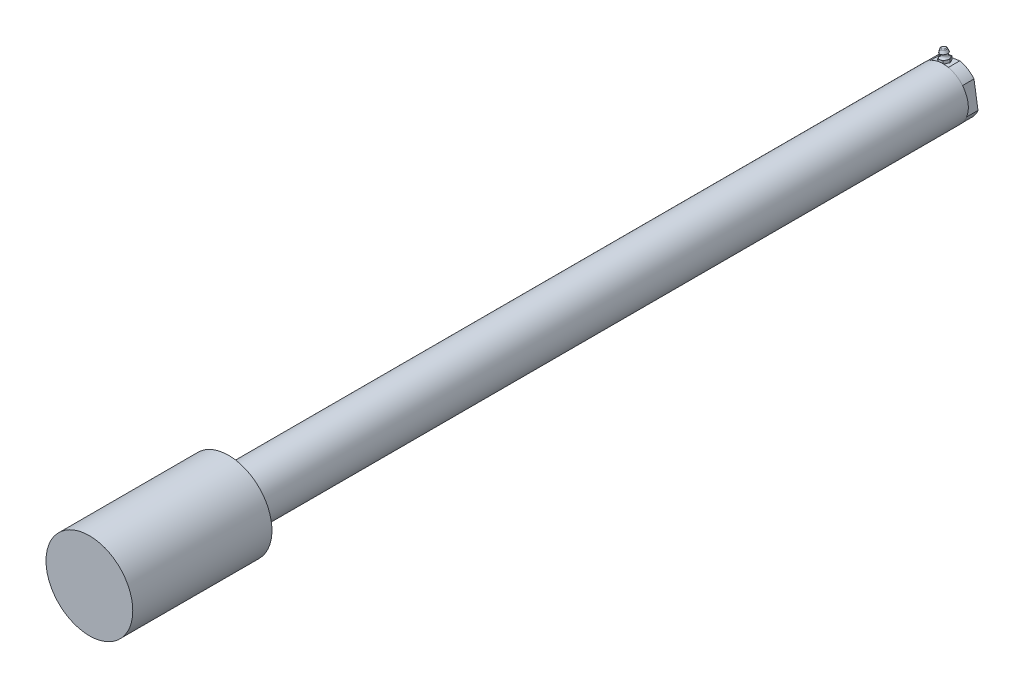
ISO-10303-21;
HEADER;
FILE_DESCRIPTION(('STEP AP214'),'2;1');
FILE_NAME('part.step','',(''),(''),'','','');
FILE_SCHEMA(('AUTOMOTIVE_DESIGN { 1 0 10303 214 1 1 1 1 }'));
ENDSEC;
DATA;
#1=APPLICATION_CONTEXT('core data for automotive mechanical design processes');
#2=APPLICATION_PROTOCOL_DEFINITION('international standard','automotive_design',2000,#1);
#3=PRODUCT_CONTEXT('',#1,'mechanical');
#4=PRODUCT('Part','Part','',(#3));
#5=PRODUCT_RELATED_PRODUCT_CATEGORY('part','',(#4));
#6=PRODUCT_DEFINITION_FORMATION('','',#4);
#7=PRODUCT_DEFINITION_CONTEXT('part definition',#1,'design');
#8=PRODUCT_DEFINITION('design','',#6,#7);
#9=PRODUCT_DEFINITION_SHAPE('','',#8);
#10=(LENGTH_UNIT() NAMED_UNIT(*) SI_UNIT(.MILLI.,.METRE.));
#11=(NAMED_UNIT(*) PLANE_ANGLE_UNIT() SI_UNIT($,.RADIAN.));
#12=(NAMED_UNIT(*) SI_UNIT($,.STERADIAN.) SOLID_ANGLE_UNIT());
#13=UNCERTAINTY_MEASURE_WITH_UNIT(LENGTH_MEASURE(1.E-05),#10,'distance_accuracy_value','');
#14=(GEOMETRIC_REPRESENTATION_CONTEXT(3) GLOBAL_UNCERTAINTY_ASSIGNED_CONTEXT((#13)) GLOBAL_UNIT_ASSIGNED_CONTEXT((#10,
#11,#12)) REPRESENTATION_CONTEXT('',''));
#15=CARTESIAN_POINT('',(0.,0.,0.));
#16=DIRECTION('',(0.,0.,1.));
#17=DIRECTION('',(1.,0.,0.));
#18=AXIS2_PLACEMENT_3D('',#15,#16,#17);
#19=CARTESIAN_POINT('',(0.,0.,-721.7156));
#20=DIRECTION('',(0.,0.,-1.));
#21=DIRECTION('',(-0.156434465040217,0.98768834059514,0.));
#22=AXIS2_PLACEMENT_3D('',#19,#20,#21);
#23=PLANE('',#22);
#24=CARTESIAN_POINT('',(0.,0.,-721.7156));
#25=DIRECTION('',(0.,0.,-1.));
#26=DIRECTION('',(-0.156434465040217,0.98768834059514,0.));
#27=AXIS2_PLACEMENT_3D('',#24,#25,#26);
#28=CIRCLE('',#27,8.73125);
#29=CARTESIAN_POINT('',(-1.3658684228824,8.62375382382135,-721.7156));
#30=VERTEX_POINT('',#29);
#31=EDGE_CURVE('E197',#30,#30,#28,.T.);
#32=ORIENTED_EDGE('',*,*,#31,.T.);
#33=EDGE_LOOP('',(#32));
#34=FACE_BOUND('',#33,.T.);
#35=ADVANCED_FACE('F19',(#34),#23,.T.);
#36=CARTESIAN_POINT('',(0.,0.,-759.8156));
#37=DIRECTION('',(0.,0.,-1.));
#38=DIRECTION('',(-0.156434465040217,0.98768834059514,0.));
#39=AXIS2_PLACEMENT_3D('',#36,#37,#38);
#40=CYLINDRICAL_SURFACE('',#39,8.73125);
#41=ORIENTED_EDGE('',*,*,#31,.F.);
#42=EDGE_LOOP('',(#41));
#43=FACE_BOUND('',#42,.T.);
#44=CARTESIAN_POINT('',(0.,0.,-759.8156));
#45=DIRECTION('',(0.,0.,-1.));
#46=DIRECTION('',(-0.156434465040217,0.98768834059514,0.));
#47=AXIS2_PLACEMENT_3D('',#44,#45,#46);
#48=CIRCLE('',#47,8.73125);
#49=CARTESIAN_POINT('',(-1.3658684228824,8.62375382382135,-759.8156));
#50=VERTEX_POINT('',#49);
#51=EDGE_CURVE('E669',#50,#50,#48,.T.);
#52=ORIENTED_EDGE('',*,*,#51,.T.);
#53=EDGE_LOOP('',(#52));
#54=FACE_BOUND('',#53,.T.);
#55=ADVANCED_FACE('F550',(#43,#54),#40,.F.);
#56=CARTESIAN_POINT('',(0.,0.,-749.6556));
#57=DIRECTION('',(0.,0.,-1.));
#58=DIRECTION('',(-0.156434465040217,0.98768834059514,0.));
#59=AXIS2_PLACEMENT_3D('',#56,#57,#58);
#60=CYLINDRICAL_SURFACE('',#59,22.1107);
#61=DIRECTION('',(0.,0.,-1.));
#62=VECTOR('',#61,1.);
#63=CARTESIAN_POINT('',(-17.0596258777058,-14.0659951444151,-726.999693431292));
#64=LINE('',#63,#62);
#65=CARTESIAN_POINT('',(-17.0596258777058,-14.0659951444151,-749.6556));
#66=VERTEX_POINT('',#65);
#67=CARTESIAN_POINT('',(-17.0596258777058,-14.0659951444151,-759.8156));
#68=VERTEX_POINT('',#67);
#69=EDGE_CURVE('E653',#66,#68,#64,.T.);
#70=ORIENTED_EDGE('',*,*,#69,.T.);
#71=CARTESIAN_POINT('',(0.,0.,-759.8156));
#72=DIRECTION('',(0.,0.,-1.));
#73=DIRECTION('',(-0.156434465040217,0.98768834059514,0.));
#74=AXIS2_PLACEMENT_3D('',#71,#72,#73);
#75=CIRCLE('',#74,22.1107);
#76=CARTESIAN_POINT('',(20.571299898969,-8.10584202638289,-759.8156));
#77=VERTEX_POINT('',#76);
#78=EDGE_CURVE('E676',#77,#68,#75,.T.);
#79=ORIENTED_EDGE('',*,*,#78,.F.);
#80=DIRECTION('',(0.,0.,-1.));
#81=VECTOR('',#80,1.);
#82=CARTESIAN_POINT('',(20.571299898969,-8.10584202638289,-726.999693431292));
#83=LINE('',#82,#81);
#84=CARTESIAN_POINT('',(20.571299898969,-8.10584202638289,-749.6556));
#85=VERTEX_POINT('',#84);
#86=EDGE_CURVE('E662',#85,#77,#83,.T.);
#87=ORIENTED_EDGE('',*,*,#86,.F.);
#88=CARTESIAN_POINT('',(0.,0.,-749.6556));
#89=DIRECTION('',(0.,0.,-1.));
#90=DIRECTION('',(-0.156434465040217,0.98768834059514,0.));
#91=AXIS2_PLACEMENT_3D('',#88,#89,#90);
#92=CIRCLE('',#91,22.1107);
#93=EDGE_CURVE('E673',#85,#66,#92,.T.);
#94=ORIENTED_EDGE('',*,*,#93,.T.);
#95=EDGE_LOOP('',(#70,#79,#87,#94));
#96=FACE_BOUND('',#95,.T.);
#97=ADVANCED_FACE('F522',(#96),#60,.T.);
#98=DIRECTION('',(0.,0.,-1.));
#99=VECTOR('',#98,1.);
#100=CARTESIAN_POINT('',(-11.0680891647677,19.1410672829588,-733.712329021));
#101=LINE('',#100,#99);
#102=CARTESIAN_POINT('',(-11.0680891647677,19.1410672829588,-749.6556));
#103=VERTEX_POINT('',#102);
#104=CARTESIAN_POINT('',(-11.0680891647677,19.1410672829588,-759.8156));
#105=VERTEX_POINT('',#104);
#106=EDGE_CURVE('E645',#103,#105,#101,.T.);
#107=ORIENTED_EDGE('',*,*,#106,.T.);
#108=CARTESIAN_POINT('',(-20.5712998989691,8.10584202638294,-759.8156));
#109=VERTEX_POINT('',#108);
#110=EDGE_CURVE('E678',#109,#105,#75,.T.);
#111=ORIENTED_EDGE('',*,*,#110,.F.);
#112=DIRECTION('',(0.,0.,-1.));
#113=VECTOR('',#112,1.);
#114=CARTESIAN_POINT('',(-20.5712998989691,8.10584202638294,-726.999693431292));
#115=LINE('',#114,#113);
#116=CARTESIAN_POINT('',(-20.5712998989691,8.10584202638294,-749.6556));
#117=VERTEX_POINT('',#116);
#118=EDGE_CURVE('E652',#117,#109,#115,.T.);
#119=ORIENTED_EDGE('',*,*,#118,.F.);
#120=EDGE_CURVE('E674',#117,#103,#92,.T.);
#121=ORIENTED_EDGE('',*,*,#120,.T.);
#122=EDGE_LOOP('',(#107,#111,#119,#121));
#123=FACE_BOUND('',#122,.T.);
#124=ADVANCED_FACE('F521',(#123),#60,.T.);
#125=CARTESIAN_POINT('',(0.,0.,-759.8156));
#126=DIRECTION('',(0.,0.,-1.));
#127=DIRECTION('',(-0.156434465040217,0.98768834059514,0.));
#128=AXIS2_PLACEMENT_3D('',#125,#126,#127);
#129=PLANE('',#128);
#130=DIRECTION('',(-0.98768834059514,-0.156434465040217,0.));
#131=VECTOR('',#130,1.);
#132=CARTESIAN_POINT('',(4.61146324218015,21.6244644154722,-759.8156));
#133=LINE('',#132,#131);
#134=CARTESIAN_POINT('',(4.61146324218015,21.6244644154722,-759.8156));
#135=VERTEX_POINT('',#134);
#136=EDGE_CURVE('E94',#135,#105,#133,.T.);
#137=ORIENTED_EDGE('',*,*,#136,.F.);
#138=CARTESIAN_POINT('',(17.0596258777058,14.0659951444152,-759.8156));
#139=VERTEX_POINT('',#138);
#140=EDGE_CURVE('E672',#135,#139,#75,.T.);
#141=ORIENTED_EDGE('',*,*,#140,.T.);
#142=DIRECTION('',(-0.156434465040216,0.98768834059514,0.));
#143=VECTOR('',#142,1.);
#144=CARTESIAN_POINT('',(20.571299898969,-8.10584202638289,-759.8156));
#145=LINE('',#144,#143);
#146=EDGE_CURVE('E659',#77,#139,#145,.T.);
#147=ORIENTED_EDGE('',*,*,#146,.F.);
#148=ORIENTED_EDGE('',*,*,#78,.T.);
#149=DIRECTION('',(0.156434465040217,-0.98768834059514,0.));
#150=VECTOR('',#149,1.);
#151=CARTESIAN_POINT('',(-17.0596258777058,-14.0659951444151,-759.8156));
#152=LINE('',#151,#150);
#153=EDGE_CURVE('E650',#109,#68,#152,.T.);
#154=ORIENTED_EDGE('',*,*,#153,.F.);
#155=ORIENTED_EDGE('',*,*,#110,.T.);
#156=EDGE_LOOP('',(#137,#141,#147,#148,#154,#155));
#157=FACE_BOUND('',#156,.T.);
#158=ORIENTED_EDGE('',*,*,#51,.F.);
#159=EDGE_LOOP('',(#158));
#160=FACE_BOUND('',#159,.T.);
#161=ADVANCED_FACE('F518',(#157,#160),#129,.T.);
#162=DIRECTION('',(0.,0.,-1.));
#163=VECTOR('',#162,1.);
#164=CARTESIAN_POINT('',(4.61146324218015,21.6244644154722,-733.712329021));
#165=LINE('',#164,#163);
#166=CARTESIAN_POINT('',(4.61146324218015,21.6244644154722,-749.6556));
#167=VERTEX_POINT('',#166);
#168=EDGE_CURVE('E644',#167,#135,#165,.T.);
#169=ORIENTED_EDGE('',*,*,#168,.F.);
#170=CARTESIAN_POINT('',(17.0596258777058,14.0659951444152,-749.6556));
#171=VERTEX_POINT('',#170);
#172=EDGE_CURVE('E675',#167,#171,#92,.T.);
#173=ORIENTED_EDGE('',*,*,#172,.T.);
#174=DIRECTION('',(0.,0.,-1.));
#175=VECTOR('',#174,1.);
#176=CARTESIAN_POINT('',(17.0596258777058,14.0659951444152,-726.999693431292));
#177=LINE('',#176,#175);
#178=EDGE_CURVE('E663',#171,#139,#177,.T.);
#179=ORIENTED_EDGE('',*,*,#178,.T.);
#180=ORIENTED_EDGE('',*,*,#140,.F.);
#181=EDGE_LOOP('',(#169,#173,#179,#180));
#182=FACE_BOUND('',#181,.T.);
#183=ADVANCED_FACE('F508',(#182),#60,.T.);
#184=CARTESIAN_POINT('',(4.61146324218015,21.6244644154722,-733.712329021));
#185=DIRECTION('',(0.156434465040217,-0.98768834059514,0.));
#186=DIRECTION('',(0.,0.,-1.));
#187=AXIS2_PLACEMENT_3D('',#184,#185,#186);
#188=PLANE('',#187);
#189=DIRECTION('',(0.98768834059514,0.156434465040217,0.));
#190=VECTOR('',#189,1.);
#191=CARTESIAN_POINT('',(4.61146324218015,21.6244644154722,-749.6556));
#192=LINE('',#191,#190);
#193=EDGE_CURVE('E647',#103,#167,#192,.T.);
#194=ORIENTED_EDGE('',*,*,#193,.T.);
#195=ORIENTED_EDGE('',*,*,#168,.T.);
#196=ORIENTED_EDGE('',*,*,#136,.T.);
#197=ORIENTED_EDGE('',*,*,#106,.F.);
#198=EDGE_LOOP('',(#194,#195,#196,#197));
#199=FACE_BOUND('',#198,.T.);
#200=DIRECTION('',(-0.98768834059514,-0.156434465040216,0.));
#201=VECTOR('',#200,1.);
#202=CARTESIAN_POINT('',(-0.965164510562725,20.7412133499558,-758.70435));
#203=LINE('',#202,#201);
#204=CARTESIAN_POINT('',(-0.965164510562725,20.7412133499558,-758.70435));
#205=VERTEX_POINT('',#204);
#206=CARTESIAN_POINT('',(-5.49146141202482,20.0243183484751,-758.70435));
#207=VERTEX_POINT('',#206);
#208=EDGE_CURVE('E11',#205,#207,#203,.T.);
#209=ORIENTED_EDGE('',*,*,#208,.F.);
#210=DIRECTION('',(-0.49384417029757,-0.0782172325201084,-0.866025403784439));
#211=VECTOR('',#210,1.);
#212=CARTESIAN_POINT('',(1.29798394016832,21.0996608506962,-754.7356));
#213=LINE('',#212,#211);
#214=CARTESIAN_POINT('',(1.29798394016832,21.0996608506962,-754.7356));
#215=VERTEX_POINT('',#214);
#216=EDGE_CURVE('E30',#215,#205,#213,.T.);
#217=ORIENTED_EDGE('',*,*,#216,.F.);
#218=DIRECTION('',(0.49384417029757,0.0782172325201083,-0.866025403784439));
#219=VECTOR('',#218,1.);
#220=CARTESIAN_POINT('',(-0.965164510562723,20.7412133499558,-750.76685));
#221=LINE('',#220,#219);
#222=CARTESIAN_POINT('',(-0.965164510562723,20.7412133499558,-750.76685));
#223=VERTEX_POINT('',#222);
#224=EDGE_CURVE('E136',#223,#215,#221,.T.);
#225=ORIENTED_EDGE('',*,*,#224,.F.);
#226=DIRECTION('',(0.98768834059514,0.156434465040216,0.));
#227=VECTOR('',#226,1.);
#228=CARTESIAN_POINT('',(-5.49146141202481,20.0243183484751,-750.76685));
#229=LINE('',#228,#227);
#230=CARTESIAN_POINT('',(-5.49146141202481,20.0243183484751,-750.76685));
#231=VERTEX_POINT('',#230);
#232=EDGE_CURVE('E139',#231,#223,#229,.T.);
#233=ORIENTED_EDGE('',*,*,#232,.F.);
#234=DIRECTION('',(0.49384417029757,0.0782172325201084,0.866025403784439));
#235=VECTOR('',#234,1.);
#236=CARTESIAN_POINT('',(-7.75460986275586,19.6658708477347,-754.7356));
#237=LINE('',#236,#235);
#238=CARTESIAN_POINT('',(-7.75460986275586,19.6658708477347,-754.7356));
#239=VERTEX_POINT('',#238);
#240=EDGE_CURVE('E156',#239,#231,#237,.T.);
#241=ORIENTED_EDGE('',*,*,#240,.F.);
#242=DIRECTION('',(-0.493844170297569,-0.0782172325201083,0.866025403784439));
#243=VECTOR('',#242,1.);
#244=CARTESIAN_POINT('',(-5.49146141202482,20.0243183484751,-758.70435));
#245=LINE('',#244,#243);
#246=EDGE_CURVE('E223',#207,#239,#245,.T.);
#247=ORIENTED_EDGE('',*,*,#246,.F.);
#248=EDGE_LOOP('',(#209,#217,#225,#233,#241,#247));
#249=FACE_BOUND('',#248,.T.);
#250=ADVANCED_FACE('F138',(#199,#249),#188,.F.);
#251=CARTESIAN_POINT('',(-17.0596258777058,-14.0659951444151,-726.999693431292));
#252=DIRECTION('',(0.98768834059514,0.156434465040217,0.));
#253=DIRECTION('',(0.,0.,-1.));
#254=AXIS2_PLACEMENT_3D('',#251,#252,#253);
#255=PLANE('',#254);
#256=DIRECTION('',(-0.156434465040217,0.98768834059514,0.));
#257=VECTOR('',#256,1.);
#258=CARTESIAN_POINT('',(-17.0596258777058,-14.0659951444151,-749.6556));
#259=LINE('',#258,#257);
#260=EDGE_CURVE('E656',#66,#117,#259,.T.);
#261=ORIENTED_EDGE('',*,*,#260,.T.);
#262=ORIENTED_EDGE('',*,*,#118,.T.);
#263=ORIENTED_EDGE('',*,*,#153,.T.);
#264=ORIENTED_EDGE('',*,*,#69,.F.);
#265=EDGE_LOOP('',(#261,#262,#263,#264));
#266=FACE_BOUND('',#265,.T.);
#267=ADVANCED_FACE('F487',(#266),#255,.F.);
#268=CARTESIAN_POINT('',(20.571299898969,-8.10584202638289,-726.999693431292));
#269=DIRECTION('',(-0.98768834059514,-0.156434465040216,0.));
#270=DIRECTION('',(-0.156434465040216,0.98768834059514,0.));
#271=AXIS2_PLACEMENT_3D('',#268,#269,#270);
#272=PLANE('',#271);
#273=DIRECTION('',(0.156434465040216,-0.98768834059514,0.));
#274=VECTOR('',#273,1.);
#275=CARTESIAN_POINT('',(20.571299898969,-8.10584202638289,-749.6556));
#276=LINE('',#275,#274);
#277=EDGE_CURVE('E666',#171,#85,#276,.T.);
#278=ORIENTED_EDGE('',*,*,#277,.T.);
#279=ORIENTED_EDGE('',*,*,#86,.T.);
#280=ORIENTED_EDGE('',*,*,#146,.T.);
#281=ORIENTED_EDGE('',*,*,#178,.F.);
#282=EDGE_LOOP('',(#278,#279,#280,#281));
#283=FACE_BOUND('',#282,.T.);
#284=ADVANCED_FACE('F468',(#283),#272,.F.);
#285=CARTESIAN_POINT('',(0.,0.,0.));
#286=DIRECTION('',(0.,0.,1.));
#287=DIRECTION('',(1.,0.,0.));
#288=AXIS2_PLACEMENT_3D('',#285,#286,#287);
#289=PLANE('',#288);
#290=CARTESIAN_POINT('',(0.,0.,0.));
#291=DIRECTION('',(0.,0.,1.));
#292=DIRECTION('',(1.,0.,0.));
#293=AXIS2_PLACEMENT_3D('',#290,#291,#292);
#294=CIRCLE('',#293,38.1);
#295=CARTESIAN_POINT('',(38.1,0.,0.));
#296=VERTEX_POINT('',#295);
#297=EDGE_CURVE('E187',#296,#296,#294,.T.);
#298=ORIENTED_EDGE('',*,*,#297,.T.);
#299=EDGE_LOOP('',(#298));
#300=FACE_BOUND('',#299,.T.);
#301=ADVANCED_FACE('F457',(#300),#289,.T.);
#302=CARTESIAN_POINT('',(0.,0.,0.));
#303=DIRECTION('',(0.,0.,-1.));
#304=DIRECTION('',(-1.,0.,0.));
#305=AXIS2_PLACEMENT_3D('',#302,#303,#304);
#306=CYLINDRICAL_SURFACE('',#305,38.1);
#307=ORIENTED_EDGE('',*,*,#297,.F.);
#308=EDGE_LOOP('',(#307));
#309=FACE_BOUND('',#308,.T.);
#310=CARTESIAN_POINT('',(0.,0.,-122.21972));
#311=DIRECTION('',(0.,0.,-1.));
#312=DIRECTION('',(-1.,0.,0.));
#313=AXIS2_PLACEMENT_3D('',#310,#311,#312);
#314=CIRCLE('',#313,38.1);
#315=CARTESIAN_POINT('',(-38.1,0.,-122.21972));
#316=VERTEX_POINT('',#315);
#317=EDGE_CURVE('E178',#316,#316,#314,.T.);
#318=ORIENTED_EDGE('',*,*,#317,.F.);
#319=EDGE_LOOP('',(#318));
#320=FACE_BOUND('',#319,.T.);
#321=ADVANCED_FACE('F454',(#309,#320),#306,.T.);
#322=CARTESIAN_POINT('',(0.,0.,-122.21972));
#323=DIRECTION('',(0.,0.,-1.));
#324=DIRECTION('',(-1.,0.,0.));
#325=AXIS2_PLACEMENT_3D('',#322,#323,#324);
#326=PLANE('',#325);
#327=CARTESIAN_POINT('',(0.,0.,-122.21972));
#328=DIRECTION('',(0.,0.,-1.));
#329=DIRECTION('',(-1.,0.,0.));
#330=AXIS2_PLACEMENT_3D('',#327,#328,#329);
#331=CIRCLE('',#330,22.225);
#332=CARTESIAN_POINT('',(-22.225,0.,-122.21972));
#333=VERTEX_POINT('',#332);
#334=EDGE_CURVE('E182',#333,#333,#331,.T.);
#335=ORIENTED_EDGE('',*,*,#334,.F.);
#336=EDGE_LOOP('',(#335));
#337=FACE_BOUND('',#336,.T.);
#338=ORIENTED_EDGE('',*,*,#317,.T.);
#339=EDGE_LOOP('',(#338));
#340=FACE_BOUND('',#339,.T.);
#341=ADVANCED_FACE('F443',(#337,#340),#326,.T.);
#342=CARTESIAN_POINT('',(0.,0.,-749.6556));
#343=DIRECTION('',(0.,0.,1.));
#344=DIRECTION('',(1.,0.,0.));
#345=AXIS2_PLACEMENT_3D('',#342,#343,#344);
#346=CYLINDRICAL_SURFACE('',#345,22.225);
#347=ORIENTED_EDGE('',*,*,#334,.T.);
#348=EDGE_LOOP('',(#347));
#349=FACE_BOUND('',#348,.T.);
#350=CARTESIAN_POINT('',(0.,0.,-749.6556));
#351=DIRECTION('',(0.,0.,-1.));
#352=DIRECTION('',(-1.,0.,0.));
#353=AXIS2_PLACEMENT_3D('',#350,#351,#352);
#354=CIRCLE('',#353,22.225);
#355=CARTESIAN_POINT('',(-22.2249999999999,0.,-749.6556));
#356=VERTEX_POINT('',#355);
#357=EDGE_CURVE('E195',#356,#356,#354,.T.);
#358=ORIENTED_EDGE('',*,*,#357,.F.);
#359=EDGE_LOOP('',(#358));
#360=FACE_BOUND('',#359,.T.);
#361=ADVANCED_FACE('F432',(#349,#360),#346,.T.);
#362=CARTESIAN_POINT('',(0.,0.,-749.6556));
#363=DIRECTION('',(0.,0.,-1.));
#364=DIRECTION('',(-1.,0.,0.));
#365=AXIS2_PLACEMENT_3D('',#362,#363,#364);
#366=PLANE('',#365);
#367=ORIENTED_EDGE('',*,*,#357,.T.);
#368=EDGE_LOOP('',(#367));
#369=FACE_BOUND('',#368,.T.);
#370=ORIENTED_EDGE('',*,*,#172,.F.);
#371=ORIENTED_EDGE('',*,*,#193,.F.);
#372=ORIENTED_EDGE('',*,*,#120,.F.);
#373=ORIENTED_EDGE('',*,*,#260,.F.);
#374=ORIENTED_EDGE('',*,*,#93,.F.);
#375=ORIENTED_EDGE('',*,*,#277,.F.);
#376=EDGE_LOOP('',(#370,#371,#372,#373,#374,#375));
#377=FACE_BOUND('',#376,.T.);
#378=ADVANCED_FACE('F422',(#369,#377),#366,.T.);
#379=CARTESIAN_POINT('',(-4.656266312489,29.3985084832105,-754.7356));
#380=DIRECTION('',(-0.156434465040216,0.98768834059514,0.));
#381=DIRECTION('',(0.,0.,1.));
#382=AXIS2_PLACEMENT_3D('',#379,#380,#381);
#383=PLANE('',#382);
#384=CARTESIAN_POINT('',(-4.656266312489,29.3985084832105,-754.7356));
#385=DIRECTION('',(-0.156434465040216,0.98768834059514,0.));
#386=DIRECTION('',(0.,0.,1.));
#387=AXIS2_PLACEMENT_3D('',#384,#385,#386);
#388=CIRCLE('',#387,1.7474960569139);
#389=CARTESIAN_POINT('',(-4.656266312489,29.3985084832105,-752.988103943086));
#390=VERTEX_POINT('',#389);
#391=EDGE_CURVE('E23',#390,#390,#388,.T.);
#392=ORIENTED_EDGE('',*,*,#391,.T.);
#393=EDGE_LOOP('',(#392));
#394=FACE_BOUND('',#393,.T.);
#395=ADVANCED_FACE('F268',(#394),#383,.T.);
#396=CARTESIAN_POINT('',(-4.53706325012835,28.645889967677,-754.7356));
#397=DIRECTION('',(-0.156434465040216,0.98768834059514,0.));
#398=DIRECTION('',(0.,0.,1.));
#399=AXIS2_PLACEMENT_3D('',#396,#397,#398);
#400=TOROIDAL_SURFACE('',#399,1.7474960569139,0.762);
#401=ORIENTED_EDGE('',*,*,#391,.F.);
#402=EDGE_LOOP('',(#401));
#403=FACE_BOUND('',#402,.T.);
#404=CARTESIAN_POINT('',(-4.57685885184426,28.8971495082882,-754.7356));
#405=DIRECTION('',(-0.156434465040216,0.98768834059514,0.));
#406=DIRECTION('',(0.,0.,1.));
#407=AXIS2_PLACEMENT_3D('',#404,#405,#406);
#408=CIRCLE('',#407,2.46577800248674);
#409=CARTESIAN_POINT('',(-4.57685885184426,28.8971495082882,-752.269821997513));
#410=VERTEX_POINT('',#409);
#411=EDGE_CURVE('E173',#410,#410,#408,.F.);
#412=ORIENTED_EDGE('',*,*,#411,.F.);
#413=EDGE_LOOP('',(#412));
#414=FACE_BOUND('',#413,.T.);
#415=ADVANCED_FACE('F21',(#403,#414),#400,.T.);
#416=CARTESIAN_POINT('',(-4.17945406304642,26.3880344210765,-754.7356));
#417=DIRECTION('',(0.156434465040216,-0.98768834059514,0.));
#418=DIRECTION('',(0.,0.,-1.));
#419=AXIS2_PLACEMENT_3D('',#416,#417,#418);
#420=CONICAL_SURFACE('',#419,3.3655,0.340381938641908);
#421=ORIENTED_EDGE('',*,*,#411,.T.);
#422=EDGE_LOOP('',(#421));
#423=FACE_BOUND('',#422,.T.);
#424=CARTESIAN_POINT('',(-4.17945406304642,26.3880344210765,-754.7356));
#425=DIRECTION('',(0.156434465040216,-0.98768834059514,0.));
#426=DIRECTION('',(0.,0.,-1.));
#427=AXIS2_PLACEMENT_3D('',#424,#425,#426);
#428=CIRCLE('',#427,3.3655);
#429=CARTESIAN_POINT('',(-4.17945406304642,26.3880344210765,-758.1011));
#430=VERTEX_POINT('',#429);
#431=EDGE_CURVE('E199',#430,#430,#428,.T.);
#432=ORIENTED_EDGE('',*,*,#431,.F.);
#433=EDGE_LOOP('',(#432));
#434=FACE_BOUND('',#433,.T.);
#435=ADVANCED_FACE('F265',(#423,#434),#420,.T.);
#436=CARTESIAN_POINT('',(-3.92942332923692,24.8094024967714,-754.7356));
#437=DIRECTION('',(0.156434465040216,-0.98768834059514,0.));
#438=DIRECTION('',(0.,0.,-1.));
#439=AXIS2_PLACEMENT_3D('',#436,#437,#438);
#440=TOROIDAL_SURFACE('',#439,5.20693450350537,2.43833450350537);
#441=ORIENTED_EDGE('',*,*,#431,.T.);
#442=EDGE_LOOP('',(#441));
#443=FACE_BOUND('',#442,.T.);
#444=CARTESIAN_POINT('',(-3.60082253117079,22.7346987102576,-754.7356));
#445=DIRECTION('',(0.156434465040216,-0.98768834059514,0.));
#446=DIRECTION('',(0.,0.,-1.));
#447=AXIS2_PLACEMENT_3D('',#444,#445,#446);
#448=CIRCLE('',#447,3.96875);
#449=CARTESIAN_POINT('',(-3.60082253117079,22.7346987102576,-758.70435));
#450=VERTEX_POINT('',#449);
#451=CARTESIAN_POINT('',(-0.206099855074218,23.2723699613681,-756.719975));
#452=VERTEX_POINT('',#451);
#453=EDGE_CURVE('E85',#450,#452,#448,.T.);
#454=ORIENTED_EDGE('',*,*,#453,.F.);
#455=CARTESIAN_POINT('',(-6.99554520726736,22.1970274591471,-756.719975));
#456=VERTEX_POINT('',#455);
#457=EDGE_CURVE('E202',#456,#450,#448,.T.);
#458=ORIENTED_EDGE('',*,*,#457,.F.);
#459=CARTESIAN_POINT('',(-6.99554520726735,22.1970274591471,-752.751225));
#460=VERTEX_POINT('',#459);
#461=EDGE_CURVE('E247',#460,#456,#448,.T.);
#462=ORIENTED_EDGE('',*,*,#461,.F.);
#463=CARTESIAN_POINT('',(-3.60082253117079,22.7346987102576,-750.76685));
#464=VERTEX_POINT('',#463);
#465=EDGE_CURVE('E246',#464,#460,#448,.T.);
#466=ORIENTED_EDGE('',*,*,#465,.F.);
#467=CARTESIAN_POINT('',(-0.206099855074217,23.2723699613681,-752.751225));
#468=VERTEX_POINT('',#467);
#469=EDGE_CURVE('E240',#468,#464,#448,.T.);
#470=ORIENTED_EDGE('',*,*,#469,.F.);
#471=EDGE_CURVE('E78',#452,#468,#448,.T.);
#472=ORIENTED_EDGE('',*,*,#471,.F.);
#473=EDGE_LOOP('',(#454,#458,#462,#466,#470,#472));
#474=FACE_BOUND('',#473,.T.);
#475=ADVANCED_FACE('F243',(#443,#474),#440,.F.);
#476=CARTESIAN_POINT('',(-5.86397098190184,22.3762512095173,-758.70435));
#477=DIRECTION('',(-0.156434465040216,0.98768834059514,0.));
#478=DIRECTION('',(0.98768834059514,0.156434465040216,0.));
#479=AXIS2_PLACEMENT_3D('',#476,#477,#478);
#480=PLANE('',#479);
#481=ORIENTED_EDGE('',*,*,#453,.T.);
#482=DIRECTION('',(-0.49384417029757,-0.0782172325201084,-0.866025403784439));
#483=VECTOR('',#482,1.);
#484=CARTESIAN_POINT('',(0.925474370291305,23.4515937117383,-754.7356));
#485=LINE('',#484,#483);
#486=CARTESIAN_POINT('',(-1.33767408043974,23.093146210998,-758.70435));
#487=VERTEX_POINT('',#486);
#488=EDGE_CURVE('E220',#452,#487,#485,.T.);
#489=ORIENTED_EDGE('',*,*,#488,.T.);
#490=DIRECTION('',(-0.98768834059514,-0.156434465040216,0.));
#491=VECTOR('',#490,1.);
#492=CARTESIAN_POINT('',(-1.33767408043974,23.093146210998,-758.70435));
#493=LINE('',#492,#491);
#494=EDGE_CURVE('E205',#487,#450,#493,.T.);
#495=ORIENTED_EDGE('',*,*,#494,.T.);
#496=EDGE_LOOP('',(#481,#489,#495));
#497=FACE_BOUND('',#496,.T.);
#498=ADVANCED_FACE('F255',(#497),#480,.T.);
#499=ORIENTED_EDGE('',*,*,#471,.T.);
#500=DIRECTION('',(0.49384417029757,0.0782172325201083,-0.866025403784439));
#501=VECTOR('',#500,1.);
#502=CARTESIAN_POINT('',(-1.33767408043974,23.093146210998,-750.76685));
#503=LINE('',#502,#501);
#504=CARTESIAN_POINT('',(0.925474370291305,23.4515937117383,-754.7356));
#505=VERTEX_POINT('',#504);
#506=EDGE_CURVE('E218',#468,#505,#503,.T.);
#507=ORIENTED_EDGE('',*,*,#506,.T.);
#508=EDGE_CURVE('E221',#505,#452,#485,.T.);
#509=ORIENTED_EDGE('',*,*,#508,.T.);
#510=EDGE_LOOP('',(#499,#507,#509));
#511=FACE_BOUND('',#510,.T.);
#512=ADVANCED_FACE('F257',(#511),#480,.T.);
#513=CARTESIAN_POINT('',(0.925474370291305,23.4515937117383,-754.7356));
#514=DIRECTION('',(-0.855363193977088,-0.135476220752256,0.5));
#515=DIRECTION('',(0.49384417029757,0.0782172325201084,0.866025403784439));
#516=AXIS2_PLACEMENT_3D('',#513,#514,#515);
#517=PLANE('',#516);
#518=ORIENTED_EDGE('',*,*,#216,.T.);
#519=DIRECTION('',(0.156434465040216,-0.98768834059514,0.));
#520=VECTOR('',#519,1.);
#521=CARTESIAN_POINT('',(-1.33767408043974,23.093146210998,-758.70435));
#522=LINE('',#521,#520);
#523=EDGE_CURVE('E165',#487,#205,#522,.T.);
#524=ORIENTED_EDGE('',*,*,#523,.F.);
#525=ORIENTED_EDGE('',*,*,#488,.F.);
#526=ORIENTED_EDGE('',*,*,#508,.F.);
#527=DIRECTION('',(0.156434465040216,-0.98768834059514,0.));
#528=VECTOR('',#527,1.);
#529=CARTESIAN_POINT('',(0.925474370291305,23.4515937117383,-754.7356));
#530=LINE('',#529,#528);
#531=EDGE_CURVE('E161',#505,#215,#530,.T.);
#532=ORIENTED_EDGE('',*,*,#531,.T.);
#533=EDGE_LOOP('',(#518,#524,#525,#526,#532));
#534=FACE_BOUND('',#533,.T.);
#535=ADVANCED_FACE('F235',(#534),#517,.F.);
#536=ORIENTED_EDGE('',*,*,#469,.T.);
#537=DIRECTION('',(0.98768834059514,0.156434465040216,0.));
#538=VECTOR('',#537,1.);
#539=CARTESIAN_POINT('',(-5.86397098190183,22.3762512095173,-750.76685));
#540=LINE('',#539,#538);
#541=CARTESIAN_POINT('',(-1.33767408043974,23.093146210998,-750.76685));
#542=VERTEX_POINT('',#541);
#543=EDGE_CURVE('E214',#464,#542,#540,.T.);
#544=ORIENTED_EDGE('',*,*,#543,.T.);
#545=EDGE_CURVE('E160',#542,#468,#503,.T.);
#546=ORIENTED_EDGE('',*,*,#545,.T.);
#547=EDGE_LOOP('',(#536,#544,#546));
#548=FACE_BOUND('',#547,.T.);
#549=ADVANCED_FACE('F239',(#548),#480,.T.);
#550=CARTESIAN_POINT('',(-1.33767408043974,23.093146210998,-750.76685));
#551=DIRECTION('',(-0.855363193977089,-0.135476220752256,-0.5));
#552=DIRECTION('',(-0.49384417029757,-0.0782172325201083,0.866025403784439));
#553=AXIS2_PLACEMENT_3D('',#550,#551,#552);
#554=PLANE('',#553);
#555=ORIENTED_EDGE('',*,*,#224,.T.);
#556=ORIENTED_EDGE('',*,*,#531,.F.);
#557=ORIENTED_EDGE('',*,*,#506,.F.);
#558=ORIENTED_EDGE('',*,*,#545,.F.);
#559=DIRECTION('',(0.156434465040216,-0.98768834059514,0.));
#560=VECTOR('',#559,1.);
#561=CARTESIAN_POINT('',(-1.33767408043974,23.093146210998,-750.76685));
#562=LINE('',#561,#560);
#563=EDGE_CURVE('E151',#542,#223,#562,.T.);
#564=ORIENTED_EDGE('',*,*,#563,.T.);
#565=EDGE_LOOP('',(#555,#556,#557,#558,#564));
#566=FACE_BOUND('',#565,.T.);
#567=ADVANCED_FACE('F158',(#566),#554,.F.);
#568=ORIENTED_EDGE('',*,*,#465,.T.);
#569=DIRECTION('',(0.49384417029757,0.0782172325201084,0.866025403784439));
#570=VECTOR('',#569,1.);
#571=CARTESIAN_POINT('',(-8.12711943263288,22.017803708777,-754.7356));
#572=LINE('',#571,#570);
#573=CARTESIAN_POINT('',(-5.86397098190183,22.3762512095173,-750.76685));
#574=VERTEX_POINT('',#573);
#575=EDGE_CURVE('E211',#460,#574,#572,.T.);
#576=ORIENTED_EDGE('',*,*,#575,.T.);
#577=EDGE_CURVE('E215',#574,#464,#540,.T.);
#578=ORIENTED_EDGE('',*,*,#577,.T.);
#579=EDGE_LOOP('',(#568,#576,#578));
#580=FACE_BOUND('',#579,.T.);
#581=ADVANCED_FACE('F273',(#580),#480,.T.);
#582=CARTESIAN_POINT('',(-5.86397098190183,22.3762512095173,-750.76685));
#583=DIRECTION('',(0.,0.,-1.));
#584=DIRECTION('',(-0.98768834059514,-0.156434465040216,0.));
#585=AXIS2_PLACEMENT_3D('',#582,#583,#584);
#586=PLANE('',#585);
#587=ORIENTED_EDGE('',*,*,#232,.T.);
#588=ORIENTED_EDGE('',*,*,#563,.F.);
#589=ORIENTED_EDGE('',*,*,#543,.F.);
#590=ORIENTED_EDGE('',*,*,#577,.F.);
#591=DIRECTION('',(0.156434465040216,-0.98768834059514,0.));
#592=VECTOR('',#591,1.);
#593=CARTESIAN_POINT('',(-5.86397098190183,22.3762512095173,-750.76685));
#594=LINE('',#593,#592);
#595=EDGE_CURVE('E155',#574,#231,#594,.T.);
#596=ORIENTED_EDGE('',*,*,#595,.T.);
#597=EDGE_LOOP('',(#587,#588,#589,#590,#596));
#598=FACE_BOUND('',#597,.T.);
#599=ADVANCED_FACE('F149',(#598),#586,.F.);
#600=CARTESIAN_POINT('',(-1.33767408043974,23.093146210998,-758.70435));
#601=DIRECTION('',(0.,0.,1.));
#602=DIRECTION('',(0.156434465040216,-0.98768834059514,0.));
#603=AXIS2_PLACEMENT_3D('',#600,#601,#602);
#604=PLANE('',#603);
#605=ORIENTED_EDGE('',*,*,#208,.T.);
#606=DIRECTION('',(0.156434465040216,-0.98768834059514,0.));
#607=VECTOR('',#606,1.);
#608=CARTESIAN_POINT('',(-5.86397098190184,22.3762512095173,-758.70435));
#609=LINE('',#608,#607);
#610=CARTESIAN_POINT('',(-5.86397098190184,22.3762512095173,-758.70435));
#611=VERTEX_POINT('',#610);
#612=EDGE_CURVE('E171',#611,#207,#609,.T.);
#613=ORIENTED_EDGE('',*,*,#612,.F.);
#614=EDGE_CURVE('E204',#450,#611,#493,.T.);
#615=ORIENTED_EDGE('',*,*,#614,.F.);
#616=ORIENTED_EDGE('',*,*,#494,.F.);
#617=ORIENTED_EDGE('',*,*,#523,.T.);
#618=EDGE_LOOP('',(#605,#613,#615,#616,#617));
#619=FACE_BOUND('',#618,.T.);
#620=ADVANCED_FACE('F231',(#619),#604,.F.);
#621=ORIENTED_EDGE('',*,*,#457,.T.);
#622=ORIENTED_EDGE('',*,*,#614,.T.);
#623=DIRECTION('',(-0.493844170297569,-0.0782172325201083,0.866025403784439));
#624=VECTOR('',#623,1.);
#625=CARTESIAN_POINT('',(-5.86397098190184,22.3762512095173,-758.70435));
#626=LINE('',#625,#624);
#627=EDGE_CURVE('E208',#611,#456,#626,.T.);
#628=ORIENTED_EDGE('',*,*,#627,.T.);
#629=EDGE_LOOP('',(#621,#622,#628));
#630=FACE_BOUND('',#629,.T.);
#631=ADVANCED_FACE('F253',(#630),#480,.T.);
#632=ORIENTED_EDGE('',*,*,#461,.T.);
#633=CARTESIAN_POINT('',(-8.12711943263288,22.017803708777,-754.7356));
#634=VERTEX_POINT('',#633);
#635=EDGE_CURVE('E207',#456,#634,#626,.T.);
#636=ORIENTED_EDGE('',*,*,#635,.T.);
#637=EDGE_CURVE('E212',#634,#460,#572,.T.);
#638=ORIENTED_EDGE('',*,*,#637,.T.);
#639=EDGE_LOOP('',(#632,#636,#638));
#640=FACE_BOUND('',#639,.T.);
#641=ADVANCED_FACE('F269',(#640),#480,.T.);
#642=CARTESIAN_POINT('',(-8.12711943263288,22.017803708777,-754.7356));
#643=DIRECTION('',(0.855363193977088,0.135476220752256,-0.5));
#644=DIRECTION('',(-0.49384417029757,-0.0782172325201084,-0.866025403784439));
#645=AXIS2_PLACEMENT_3D('',#642,#643,#644);
#646=PLANE('',#645);
#647=ORIENTED_EDGE('',*,*,#240,.T.);
#648=ORIENTED_EDGE('',*,*,#595,.F.);
#649=ORIENTED_EDGE('',*,*,#575,.F.);
#650=ORIENTED_EDGE('',*,*,#637,.F.);
#651=DIRECTION('',(0.156434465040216,-0.98768834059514,0.));
#652=VECTOR('',#651,1.);
#653=CARTESIAN_POINT('',(-8.12711943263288,22.017803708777,-754.7356));
#654=LINE('',#653,#652);
#655=EDGE_CURVE('E163',#634,#239,#654,.T.);
#656=ORIENTED_EDGE('',*,*,#655,.T.);
#657=EDGE_LOOP('',(#647,#648,#649,#650,#656));
#658=FACE_BOUND('',#657,.T.);
#659=ADVANCED_FACE('F281',(#658),#646,.F.);
#660=CARTESIAN_POINT('',(-5.86397098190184,22.3762512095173,-758.70435));
#661=DIRECTION('',(0.855363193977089,0.135476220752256,0.5));
#662=DIRECTION('',(0.49384417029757,0.0782172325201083,-0.866025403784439));
#663=AXIS2_PLACEMENT_3D('',#660,#661,#662);
#664=PLANE('',#663);
#665=ORIENTED_EDGE('',*,*,#246,.T.);
#666=ORIENTED_EDGE('',*,*,#655,.F.);
#667=ORIENTED_EDGE('',*,*,#635,.F.);
#668=ORIENTED_EDGE('',*,*,#627,.F.);
#669=ORIENTED_EDGE('',*,*,#612,.T.);
#670=EDGE_LOOP('',(#665,#666,#667,#668,#669));
#671=FACE_BOUND('',#670,.T.);
#672=ADVANCED_FACE('F289',(#671),#664,.F.);
#673=CLOSED_SHELL('',(#35,#55,#97,#124,#161,#183,#250,#267,#284,#301,#321,#341,#361,#378,#395,
#415,#435,#475,#498,#512,#535,#549,#567,#581,#599,#620,#631,#641,#659,#672));
#674=CARTESIAN_POINT('',(-2.48329382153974,15.6789001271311,-757.7836));
#675=DIRECTION('',(0.156434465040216,-0.98768834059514,0.));
#676=DIRECTION('',(0.,0.,-1.));
#677=AXIS2_PLACEMENT_3D('',#674,#675,#676);
#678=PLANE('',#677);
#679=CARTESIAN_POINT('',(-2.48329382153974,15.6789001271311,-754.7356));
#680=DIRECTION('',(0.156434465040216,-0.98768834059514,0.));
#681=DIRECTION('',(0.98768834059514,0.156434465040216,0.));
#682=AXIS2_PLACEMENT_3D('',#679,#680,#681);
#683=CIRCLE('',#682,2.54);
#684=CARTESIAN_POINT('',(0.0254345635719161,16.0762436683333,-754.7356));
#685=VERTEX_POINT('',#684);
#686=EDGE_CURVE('E191',#685,#685,#683,.F.);
#687=ORIENTED_EDGE('',*,*,#686,.F.);
#688=EDGE_LOOP('',(#687));
#689=FACE_BOUND('',#688,.T.);
#690=ADVANCED_FACE('F383',(#689),#678,.T.);
#691=CARTESIAN_POINT('',(-1.63893879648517,10.3478523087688,-754.7356));
#692=DIRECTION('',(-0.156434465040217,0.98768834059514,0.));
#693=DIRECTION('',(0.,0.,1.));
#694=AXIS2_PLACEMENT_3D('',#691,#692,#693);
#695=CYLINDRICAL_SURFACE('',#694,2.54);
#696=ORIENTED_EDGE('',*,*,#686,.T.);
#697=EDGE_LOOP('',(#696));
#698=FACE_BOUND('',#697,.T.);
#699=CARTESIAN_POINT('',(-1.63893879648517,10.3478523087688,-754.7356));
#700=DIRECTION('',(-0.156434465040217,0.98768834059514,0.));
#701=DIRECTION('',(0.,0.,1.));
#702=AXIS2_PLACEMENT_3D('',#699,#700,#701);
#703=CIRCLE('',#702,2.54);
#704=CARTESIAN_POINT('',(-1.63893879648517,10.3478523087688,-752.1956));
#705=VERTEX_POINT('',#704);
#706=EDGE_CURVE('E638',#705,#705,#703,.T.);
#707=ORIENTED_EDGE('',*,*,#706,.F.);
#708=EDGE_LOOP('',(#707));
#709=FACE_BOUND('',#708,.T.);
#710=ADVANCED_FACE('F387',(#698,#709),#695,.F.);
#711=CARTESIAN_POINT('',(-1.63893879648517,10.3478523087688,-754.7356));
#712=DIRECTION('',(-0.156434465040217,0.98768834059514,0.));
#713=DIRECTION('',(0.,0.,1.));
#714=AXIS2_PLACEMENT_3D('',#711,#712,#713);
#715=PLANE('',#714);
#716=ORIENTED_EDGE('',*,*,#706,.T.);
#717=EDGE_LOOP('',(#716));
#718=FACE_BOUND('',#717,.T.);
#719=ADVANCED_FACE('F396',(#718),#715,.T.);
#720=CLOSED_SHELL('',(#690,#710,#719));
#721=ORIENTED_CLOSED_SHELL('',*,#720,.T.);
#722=BREP_WITH_VOIDS('B1',#673,(#721));
#723=ADVANCED_BREP_SHAPE_REPRESENTATION('',(#18,#722),#14);
#724=SHAPE_DEFINITION_REPRESENTATION(#9,#723);
ENDSEC;
END-ISO-10303-21;
